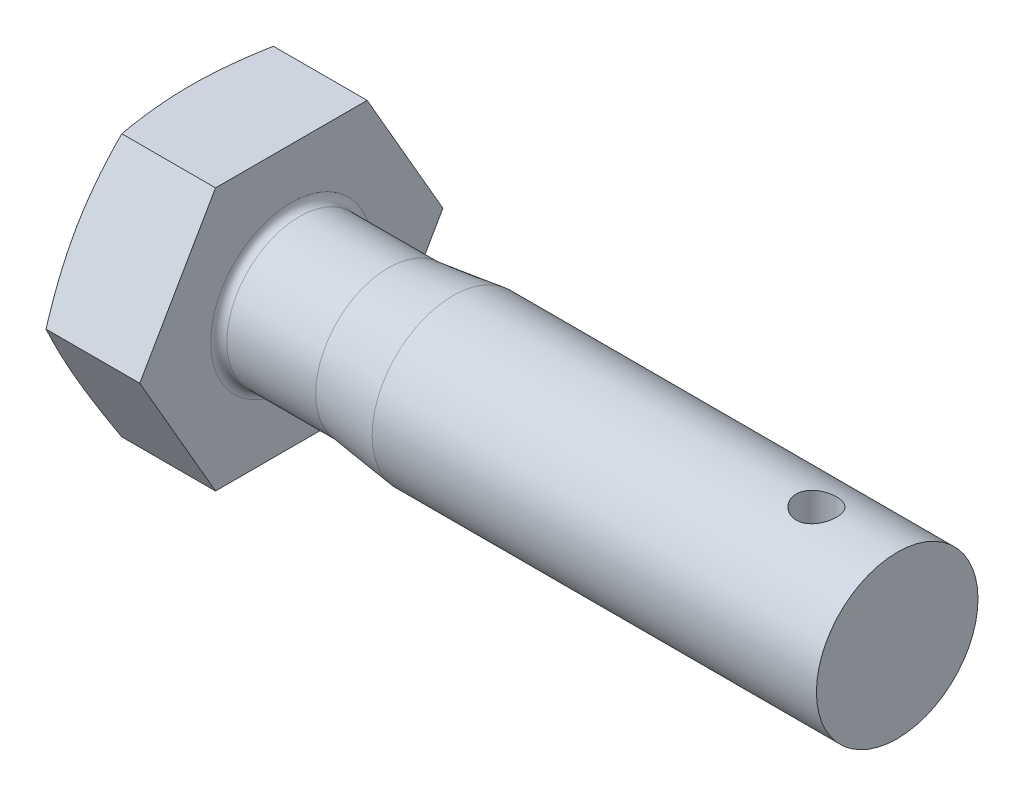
from build123d import *

# Parameters (mm, degrees)
BASEHEAD_DEPTH     = 5.3
SKETCH2_R          = 4
BASEBODY_DEPTH     = 30
SKETCH4_R          = 4.6
CUT_EXTRUDE1_DEPTH = 1.06
HEADFILLET_R       = 0.4
HOLE_DEPTH         = 37.669787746
HOLE_DEPTH_BACK    = 37.669787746
SKETCH6_R          = 1


with BuildPart() as part:
    # Sketch1 → BaseHead (new body)
    with BuildSketch(Plane(origin=(0, 0, 0), x_dir=(0, 0, -1), z_dir=(1, 0, 0))):
        Polygon((3.75277675, -6.5), (7.505553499, 0), (3.75277675, 6.5), (-3.75277675, 6.5), (-7.505553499, 0), (-3.75277675, -6.5), align=None)
    extrude(amount=BASEHEAD_DEPTH)

    # Sketch2 → BaseBody (add)
    with BuildSketch(Plane(origin=(5.3, 0, 0), x_dir=(0, 0, -1), z_dir=(1, 0, 0))):
        Circle(SKETCH2_R)
    extrude(amount=BASEBODY_DEPTH)

    # Sketch3 → HeadChamfer (revolve, cut)
    with BuildSketch(Plane(origin=(3.161211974, 0, 2.612290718), x_dir=(0, 0, -1), z_dir=(0, 1, 0)), mode=Mode.PRIVATE) as headchamfer_sk:
        Polygon((10.117844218, 3.161211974), (10.117844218, 2.504044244), (8.312290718, 3.161211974), align=None)
    revolve(headchamfer_sk.sketch.rotate(Axis((1.089857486, 0, 0), (1, 0, 0)), 180), axis=Axis((1.089857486, 0, 0), (1, 0, 0)), mode=Mode.SUBTRACT)

    # Sketch4 → Cut-Extrude1 (cut)
    with BuildSketch(Plane(origin=(0, 0, 0), x_dir=(0, 0, -1), z_dir=(1, 0, 0))):
        Circle(SKETCH4_R)
    extrude(amount=CUT_EXTRUDE1_DEPTH, mode=Mode.SUBTRACT)

    # Sketch5 → Cut-Revolve1 (revolve, cut)
    with BuildSketch(Plane(origin=(-2.92963122, 0, 7.92963122), x_dir=(0, 0, -1), z_dir=(0, 1, 0)), mode=Mode.PRIVATE) as cut_revolve1_sk:
        Polygon((11.92963122, -16.22963122), (11.52363122, -13.02963122), (11.52363122, -8.22963122), (15.11763122, -8.22963122), (15.11763122, -16.22963122), align=None)
    revolve(cut_revolve1_sk.sketch.rotate(Axis((0, 0, 0), (1, 0, 0)), 180), axis=Axis((0, 0, 0), (1, 0, 0)), mode=Mode.SUBTRACT)

    # HeadFillet
    headfillet_edges = [part.edges().sort_by_distance(p)[0] for p in [
        (5.3, 0, -3.594),
    ]]
    fillet(headfillet_edges, radius=HEADFILLET_R)

    # Sketch6 → Hole (cut, two sides: drawn at the far end of the back side and taken through both)
    with BuildSketch(Plane(origin=(0, 0, 0), x_dir=(1, 0, 0), z_dir=(0, 1, 0)).offset(-HOLE_DEPTH_BACK)):
        with Locations(Location((31.3, 0, 0), (0, 0, 270))):
            Circle(SKETCH6_R)
    extrude(amount=HOLE_DEPTH + HOLE_DEPTH_BACK, mode=Mode.SUBTRACT)


solid = part.part
